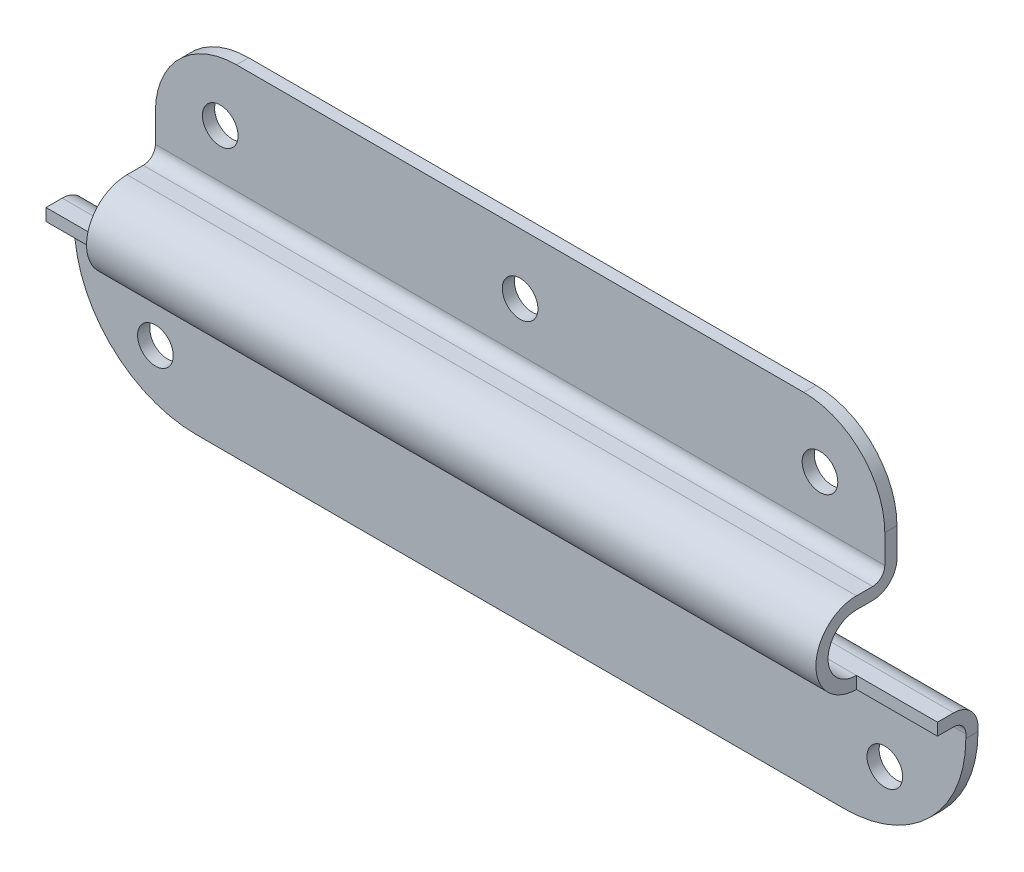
ISO-10303-21;
HEADER;
FILE_DESCRIPTION(('STEP AP214'),'2;1');
FILE_NAME('part.step','',(''),(''),'','','');
FILE_SCHEMA(('AUTOMOTIVE_DESIGN { 1 0 10303 214 1 1 1 1 }'));
ENDSEC;
DATA;
#1=APPLICATION_CONTEXT('core data for automotive mechanical design processes');
#2=APPLICATION_PROTOCOL_DEFINITION('international standard','automotive_design',2000,#1);
#3=PRODUCT_CONTEXT('',#1,'mechanical');
#4=PRODUCT('Part','Part','',(#3));
#5=PRODUCT_RELATED_PRODUCT_CATEGORY('part','',(#4));
#6=PRODUCT_DEFINITION_FORMATION('','',#4);
#7=PRODUCT_DEFINITION_CONTEXT('part definition',#1,'design');
#8=PRODUCT_DEFINITION('design','',#6,#7);
#9=PRODUCT_DEFINITION_SHAPE('','',#8);
#10=(LENGTH_UNIT() NAMED_UNIT(*) SI_UNIT(.MILLI.,.METRE.));
#11=(NAMED_UNIT(*) PLANE_ANGLE_UNIT() SI_UNIT($,.RADIAN.));
#12=(NAMED_UNIT(*) SI_UNIT($,.STERADIAN.) SOLID_ANGLE_UNIT());
#13=UNCERTAINTY_MEASURE_WITH_UNIT(LENGTH_MEASURE(1.E-05),#10,'distance_accuracy_value','');
#14=(GEOMETRIC_REPRESENTATION_CONTEXT(3) GLOBAL_UNCERTAINTY_ASSIGNED_CONTEXT((#13)) GLOBAL_UNIT_ASSIGNED_CONTEXT((#10,
#11,#12)) REPRESENTATION_CONTEXT('',''));
#15=CARTESIAN_POINT('',(0.,0.,0.));
#16=DIRECTION('',(0.,0.,1.));
#17=DIRECTION('',(1.,0.,0.));
#18=AXIS2_PLACEMENT_3D('',#15,#16,#17);
#19=CARTESIAN_POINT('',(55.,6.5,-2.));
#20=DIRECTION('',(-1.,0.,0.));
#21=DIRECTION('',(0.,0.,1.));
#22=AXIS2_PLACEMENT_3D('',#19,#20,#21);
#23=PLANE('',#22);
#24=DIRECTION('',(0.,-1.,0.));
#25=VECTOR('',#24,1.);
#26=CARTESIAN_POINT('',(55.,5.,0.));
#27=LINE('',#26,#25);
#28=CARTESIAN_POINT('',(55.,-3.5,0.));
#29=VERTEX_POINT('',#28);
#30=CARTESIAN_POINT('',(55.,-5.,0.));
#31=VERTEX_POINT('',#30);
#32=EDGE_CURVE('E540',#29,#31,#27,.T.);
#33=ORIENTED_EDGE('',*,*,#32,.T.);
#34=DIRECTION('',(0.,0.,-1.));
#35=VECTOR('',#34,1.);
#36=CARTESIAN_POINT('',(55.,-5.,0.));
#37=LINE('',#36,#35);
#38=CARTESIAN_POINT('',(55.,-5.,-2.));
#39=VERTEX_POINT('',#38);
#40=EDGE_CURVE('E268',#31,#39,#37,.T.);
#41=ORIENTED_EDGE('',*,*,#40,.T.);
#42=CARTESIAN_POINT('',(55.,-6.5,-2.));
#43=DIRECTION('',(-1.,0.,0.));
#44=DIRECTION('',(0.,0.,1.));
#45=AXIS2_PLACEMENT_3D('',#42,#43,#44);
#46=CIRCLE('',#45,1.5);
#47=CARTESIAN_POINT('',(55.,-6.5,-3.5));
#48=VERTEX_POINT('',#47);
#49=EDGE_CURVE('E270',#39,#48,#46,.T.);
#50=ORIENTED_EDGE('',*,*,#49,.T.);
#51=DIRECTION('',(0.,-1.,0.));
#52=VECTOR('',#51,1.);
#53=CARTESIAN_POINT('',(55.,-6.5,-3.5));
#54=LINE('',#53,#52);
#55=CARTESIAN_POINT('',(55.,-7.,-3.5));
#56=VERTEX_POINT('',#55);
#57=EDGE_CURVE('E273',#48,#56,#54,.T.);
#58=ORIENTED_EDGE('',*,*,#57,.T.);
#59=DIRECTION('',(0.,0.,1.));
#60=VECTOR('',#59,1.);
#61=CARTESIAN_POINT('',(55.,-7.,-5.));
#62=LINE('',#61,#60);
#63=CARTESIAN_POINT('',(55.,-7.,-5.));
#64=VERTEX_POINT('',#63);
#65=EDGE_CURVE('E241',#64,#56,#62,.T.);
#66=ORIENTED_EDGE('',*,*,#65,.F.);
#67=DIRECTION('',(0.,1.,0.));
#68=VECTOR('',#67,1.);
#69=CARTESIAN_POINT('',(55.,-22.,-5.));
#70=LINE('',#69,#68);
#71=CARTESIAN_POINT('',(55.,-6.5,-5.));
#72=VERTEX_POINT('',#71);
#73=EDGE_CURVE('E276',#64,#72,#70,.T.);
#74=ORIENTED_EDGE('',*,*,#73,.T.);
#75=CARTESIAN_POINT('',(55.,-6.5,-2.));
#76=DIRECTION('',(1.,0.,0.));
#77=DIRECTION('',(0.,0.,-1.));
#78=AXIS2_PLACEMENT_3D('',#75,#76,#77);
#79=CIRCLE('',#78,3.);
#80=CARTESIAN_POINT('',(55.,-3.5,-2.));
#81=VERTEX_POINT('',#80);
#82=EDGE_CURVE('E278',#72,#81,#79,.T.);
#83=ORIENTED_EDGE('',*,*,#82,.T.);
#84=DIRECTION('',(0.,0.,1.));
#85=VECTOR('',#84,1.);
#86=CARTESIAN_POINT('',(55.,-3.5,-2.));
#87=LINE('',#86,#85);
#88=EDGE_CURVE('E280',#81,#29,#87,.T.);
#89=ORIENTED_EDGE('',*,*,#88,.T.);
#90=EDGE_LOOP('',(#33,#41,#50,#58,#66,#74,#83,#89));
#91=FACE_BOUND('',#90,.T.);
#92=ADVANCED_FACE('F35',(#91),#23,.F.);
#93=CARTESIAN_POINT('',(55.,20.,-5.));
#94=DIRECTION('',(0.,-1.,0.));
#95=DIRECTION('',(0.,0.,-1.));
#96=AXIS2_PLACEMENT_3D('',#93,#94,#95);
#97=PLANE('',#96);
#98=DIRECTION('',(0.,0.,1.));
#99=VECTOR('',#98,1.);
#100=CARTESIAN_POINT('',(-35.,20.,-5.));
#101=LINE('',#100,#99);
#102=CARTESIAN_POINT('',(-35.,20.,-5.));
#103=VERTEX_POINT('',#102);
#104=CARTESIAN_POINT('',(-35.,20.,-3.5));
#105=VERTEX_POINT('',#104);
#106=EDGE_CURVE('E402',#103,#105,#101,.T.);
#107=ORIENTED_EDGE('',*,*,#106,.T.);
#108=DIRECTION('',(-1.,0.,0.));
#109=VECTOR('',#108,1.);
#110=CARTESIAN_POINT('',(55.,20.,-3.5));
#111=LINE('',#110,#109);
#112=CARTESIAN_POINT('',(35.,20.,-3.5));
#113=VERTEX_POINT('',#112);
#114=EDGE_CURVE('E11',#113,#105,#111,.T.);
#115=ORIENTED_EDGE('',*,*,#114,.F.);
#116=DIRECTION('',(0.,0.,1.));
#117=VECTOR('',#116,1.);
#118=CARTESIAN_POINT('',(35.,20.,-5.));
#119=LINE('',#118,#117);
#120=CARTESIAN_POINT('',(35.,20.,-5.));
#121=VERTEX_POINT('',#120);
#122=EDGE_CURVE('E253',#121,#113,#119,.T.);
#123=ORIENTED_EDGE('',*,*,#122,.F.);
#124=DIRECTION('',(-1.,0.,0.));
#125=VECTOR('',#124,1.);
#126=CARTESIAN_POINT('',(55.,20.,-5.));
#127=LINE('',#126,#125);
#128=EDGE_CURVE('E283',#121,#103,#127,.T.);
#129=ORIENTED_EDGE('',*,*,#128,.T.);
#130=EDGE_LOOP('',(#107,#115,#123,#129));
#131=FACE_BOUND('',#130,.T.);
#132=ADVANCED_FACE('F37',(#131),#97,.F.);
#133=CARTESIAN_POINT('',(55.,-22.,-3.5));
#134=DIRECTION('',(0.,1.,0.));
#135=DIRECTION('',(0.,0.,1.));
#136=AXIS2_PLACEMENT_3D('',#133,#134,#135);
#137=PLANE('',#136);
#138=DIRECTION('',(-1.,0.,0.));
#139=VECTOR('',#138,1.);
#140=CARTESIAN_POINT('',(55.,-22.,-3.5));
#141=LINE('',#140,#139);
#142=CARTESIAN_POINT('',(40.,-22.,-3.5));
#143=VERTEX_POINT('',#142);
#144=CARTESIAN_POINT('',(-40.,-22.,-3.5));
#145=VERTEX_POINT('',#144);
#146=EDGE_CURVE('E319',#143,#145,#141,.T.);
#147=ORIENTED_EDGE('',*,*,#146,.T.);
#148=DIRECTION('',(0.,0.,1.));
#149=VECTOR('',#148,1.);
#150=CARTESIAN_POINT('',(-40.,-22.,-5.));
#151=LINE('',#150,#149);
#152=CARTESIAN_POINT('',(-40.,-22.,-5.));
#153=VERTEX_POINT('',#152);
#154=EDGE_CURVE('E391',#153,#145,#151,.T.);
#155=ORIENTED_EDGE('',*,*,#154,.F.);
#156=DIRECTION('',(-1.,0.,0.));
#157=VECTOR('',#156,1.);
#158=CARTESIAN_POINT('',(55.,-22.,-5.));
#159=LINE('',#158,#157);
#160=CARTESIAN_POINT('',(40.,-22.,-5.));
#161=VERTEX_POINT('',#160);
#162=EDGE_CURVE('E316',#161,#153,#159,.T.);
#163=ORIENTED_EDGE('',*,*,#162,.F.);
#164=DIRECTION('',(0.,0.,1.));
#165=VECTOR('',#164,1.);
#166=CARTESIAN_POINT('',(40.,-22.,-5.));
#167=LINE('',#166,#165);
#168=EDGE_CURVE('E58',#161,#143,#167,.T.);
#169=ORIENTED_EDGE('',*,*,#168,.T.);
#170=EDGE_LOOP('',(#147,#155,#163,#169));
#171=FACE_BOUND('',#170,.T.);
#172=ADVANCED_FACE('F447',(#171),#137,.F.);
#173=CARTESIAN_POINT('',(55.,20.,-3.5));
#174=DIRECTION('',(0.,0.,-1.));
#175=DIRECTION('',(0.,1.,0.));
#176=AXIS2_PLACEMENT_3D('',#173,#174,#175);
#177=PLANE('',#176);
#178=CARTESIAN_POINT('',(-37.,12.5,-3.5));
#179=DIRECTION('',(0.,0.,-1.));
#180=DIRECTION('',(0.,1.,0.));
#181=AXIS2_PLACEMENT_3D('',#178,#179,#180);
#182=CIRCLE('',#181,2.2);
#183=CARTESIAN_POINT('',(-37.,14.7,-3.5));
#184=VERTEX_POINT('',#183);
#185=EDGE_CURVE('E372',#184,#184,#182,.T.);
#186=ORIENTED_EDGE('',*,*,#185,.T.);
#187=EDGE_LOOP('',(#186));
#188=FACE_BOUND('',#187,.T.);
#189=CARTESIAN_POINT('',(0.,12.5,-3.5));
#190=DIRECTION('',(0.,0.,-1.));
#191=DIRECTION('',(0.,1.,0.));
#192=AXIS2_PLACEMENT_3D('',#189,#190,#191);
#193=CIRCLE('',#192,2.2);
#194=CARTESIAN_POINT('',(0.,14.7,-3.5));
#195=VERTEX_POINT('',#194);
#196=EDGE_CURVE('E378',#195,#195,#193,.T.);
#197=ORIENTED_EDGE('',*,*,#196,.T.);
#198=EDGE_LOOP('',(#197));
#199=FACE_BOUND('',#198,.T.);
#200=CARTESIAN_POINT('',(37.,12.5,-3.5));
#201=DIRECTION('',(0.,0.,-1.));
#202=DIRECTION('',(0.,1.,0.));
#203=AXIS2_PLACEMENT_3D('',#200,#201,#202);
#204=CIRCLE('',#203,2.2);
#205=CARTESIAN_POINT('',(37.,14.7,-3.5));
#206=VERTEX_POINT('',#205);
#207=EDGE_CURVE('E384',#206,#206,#204,.T.);
#208=ORIENTED_EDGE('',*,*,#207,.T.);
#209=EDGE_LOOP('',(#208));
#210=FACE_BOUND('',#209,.T.);
#211=ORIENTED_EDGE('',*,*,#114,.T.);
#212=CARTESIAN_POINT('',(-35.,10.,-3.5));
#213=DIRECTION('',(0.,0.,-1.));
#214=DIRECTION('',(0.,1.,0.));
#215=AXIS2_PLACEMENT_3D('',#212,#213,#214);
#216=CIRCLE('',#215,10.);
#217=CARTESIAN_POINT('',(-45.,10.,-3.5));
#218=VERTEX_POINT('',#217);
#219=EDGE_CURVE('E231',#105,#218,#216,.F.);
#220=ORIENTED_EDGE('',*,*,#219,.T.);
#221=DIRECTION('',(0.,-1.,0.));
#222=VECTOR('',#221,1.);
#223=CARTESIAN_POINT('',(-45.,19.9999999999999,-3.5));
#224=LINE('',#223,#222);
#225=CARTESIAN_POINT('',(-45.,6.5,-3.5));
#226=VERTEX_POINT('',#225);
#227=EDGE_CURVE('E230',#218,#226,#224,.T.);
#228=ORIENTED_EDGE('',*,*,#227,.T.);
#229=DIRECTION('',(-1.,0.,0.));
#230=VECTOR('',#229,1.);
#231=CARTESIAN_POINT('',(55.,6.5,-3.5));
#232=LINE('',#231,#230);
#233=CARTESIAN_POINT('',(45.,6.5,-3.5));
#234=VERTEX_POINT('',#233);
#235=EDGE_CURVE('E43',#234,#226,#232,.T.);
#236=ORIENTED_EDGE('',*,*,#235,.F.);
#237=DIRECTION('',(0.,1.,0.));
#238=VECTOR('',#237,1.);
#239=CARTESIAN_POINT('',(45.,20.,-3.5));
#240=LINE('',#239,#238);
#241=CARTESIAN_POINT('',(45.,10.,-3.5));
#242=VERTEX_POINT('',#241);
#243=EDGE_CURVE('E228',#234,#242,#240,.T.);
#244=ORIENTED_EDGE('',*,*,#243,.T.);
#245=CARTESIAN_POINT('',(35.,10.,-3.5));
#246=DIRECTION('',(0.,0.,-1.));
#247=DIRECTION('',(0.,1.,0.));
#248=AXIS2_PLACEMENT_3D('',#245,#246,#247);
#249=CIRCLE('',#248,10.);
#250=EDGE_CURVE('E257',#242,#113,#249,.F.);
#251=ORIENTED_EDGE('',*,*,#250,.T.);
#252=EDGE_LOOP('',(#211,#220,#228,#236,#244,#251));
#253=FACE_BOUND('',#252,.T.);
#254=ADVANCED_FACE('F226',(#188,#199,#210,#253),#177,.F.);
#255=CARTESIAN_POINT('',(55.,6.5,-2.));
#256=DIRECTION('',(-1.,0.,0.));
#257=DIRECTION('',(0.,0.,1.));
#258=AXIS2_PLACEMENT_3D('',#255,#256,#257);
#259=CYLINDRICAL_SURFACE('',#258,1.5);
#260=ORIENTED_EDGE('',*,*,#235,.T.);
#261=CARTESIAN_POINT('',(-45.,6.5,-2.));
#262=DIRECTION('',(1.,0.,0.));
#263=DIRECTION('',(0.,1.,0.));
#264=AXIS2_PLACEMENT_3D('',#261,#262,#263);
#265=CIRCLE('',#264,1.5);
#266=CARTESIAN_POINT('',(-45.,5.,-2.));
#267=VERTEX_POINT('',#266);
#268=EDGE_CURVE('E222',#226,#267,#265,.F.);
#269=ORIENTED_EDGE('',*,*,#268,.T.);
#270=DIRECTION('',(-1.,0.,0.));
#271=VECTOR('',#270,1.);
#272=CARTESIAN_POINT('',(55.,5.,-2.));
#273=LINE('',#272,#271);
#274=CARTESIAN_POINT('',(45.,5.,-2.));
#275=VERTEX_POINT('',#274);
#276=EDGE_CURVE('E211',#275,#267,#273,.T.);
#277=ORIENTED_EDGE('',*,*,#276,.F.);
#278=CARTESIAN_POINT('',(45.,6.5,-2.));
#279=DIRECTION('',(-1.,0.,0.));
#280=DIRECTION('',(0.,-1.,0.));
#281=AXIS2_PLACEMENT_3D('',#278,#279,#280);
#282=CIRCLE('',#281,1.5);
#283=EDGE_CURVE('E202',#275,#234,#282,.F.);
#284=ORIENTED_EDGE('',*,*,#283,.T.);
#285=EDGE_LOOP('',(#260,#269,#277,#284));
#286=FACE_BOUND('',#285,.T.);
#287=ADVANCED_FACE('F221',(#286),#259,.F.);
#288=CARTESIAN_POINT('',(55.,5.,-2.));
#289=DIRECTION('',(0.,-1.,0.));
#290=DIRECTION('',(0.,0.,-1.));
#291=AXIS2_PLACEMENT_3D('',#288,#289,#290);
#292=PLANE('',#291);
#293=ORIENTED_EDGE('',*,*,#276,.T.);
#294=DIRECTION('',(0.,0.,1.));
#295=VECTOR('',#294,1.);
#296=CARTESIAN_POINT('',(-45.,5.,-2.));
#297=LINE('',#296,#295);
#298=CARTESIAN_POINT('',(-45.,5.,0.));
#299=VERTEX_POINT('',#298);
#300=EDGE_CURVE('E210',#267,#299,#297,.T.);
#301=ORIENTED_EDGE('',*,*,#300,.T.);
#302=DIRECTION('',(-1.,0.,0.));
#303=VECTOR('',#302,1.);
#304=CARTESIAN_POINT('',(55.,5.,0.));
#305=LINE('',#304,#303);
#306=CARTESIAN_POINT('',(45.,5.,0.));
#307=VERTEX_POINT('',#306);
#308=EDGE_CURVE('E189',#307,#299,#305,.T.);
#309=ORIENTED_EDGE('',*,*,#308,.F.);
#310=DIRECTION('',(0.,0.,-1.));
#311=VECTOR('',#310,1.);
#312=CARTESIAN_POINT('',(45.,5.,-2.));
#313=LINE('',#312,#311);
#314=EDGE_CURVE('E199',#307,#275,#313,.T.);
#315=ORIENTED_EDGE('',*,*,#314,.T.);
#316=EDGE_LOOP('',(#293,#301,#309,#315));
#317=FACE_BOUND('',#316,.T.);
#318=ADVANCED_FACE('F209',(#317),#292,.F.);
#319=CARTESIAN_POINT('',(55.,0.,0.));
#320=DIRECTION('',(-1.,0.,0.));
#321=DIRECTION('',(0.,0.,1.));
#322=AXIS2_PLACEMENT_3D('',#319,#320,#321);
#323=CYLINDRICAL_SURFACE('',#322,5.);
#324=CARTESIAN_POINT('',(45.,0.,0.));
#325=DIRECTION('',(-1.,0.,0.));
#326=DIRECTION('',(0.,0.,1.));
#327=AXIS2_PLACEMENT_3D('',#324,#325,#326);
#328=CIRCLE('',#327,5.);
#329=CARTESIAN_POINT('',(45.,-5.,0.));
#330=VERTEX_POINT('',#329);
#331=EDGE_CURVE('E184',#330,#307,#328,.T.);
#332=ORIENTED_EDGE('',*,*,#331,.T.);
#333=ORIENTED_EDGE('',*,*,#308,.T.);
#334=CARTESIAN_POINT('',(-45.,0.,0.));
#335=DIRECTION('',(1.,0.,0.));
#336=DIRECTION('',(0.,0.,-1.));
#337=AXIS2_PLACEMENT_3D('',#334,#335,#336);
#338=CIRCLE('',#337,5.);
#339=CARTESIAN_POINT('',(-45.,-5.,0.));
#340=VERTEX_POINT('',#339);
#341=EDGE_CURVE('E337',#299,#340,#338,.T.);
#342=ORIENTED_EDGE('',*,*,#341,.T.);
#343=DIRECTION('',(-1.,0.,0.));
#344=VECTOR('',#343,1.);
#345=CARTESIAN_POINT('',(55.,-5.,0.));
#346=LINE('',#345,#344);
#347=EDGE_CURVE('E190',#330,#340,#346,.T.);
#348=ORIENTED_EDGE('',*,*,#347,.F.);
#349=EDGE_LOOP('',(#332,#333,#342,#348));
#350=FACE_BOUND('',#349,.T.);
#351=ADVANCED_FACE('F186',(#350),#323,.T.);
#352=CARTESIAN_POINT('',(55.,-5.,0.));
#353=DIRECTION('',(0.,1.,0.));
#354=DIRECTION('',(0.,0.,1.));
#355=AXIS2_PLACEMENT_3D('',#352,#353,#354);
#356=PLANE('',#355);
#357=DIRECTION('',(0.,0.,-1.));
#358=VECTOR('',#357,1.);
#359=CARTESIAN_POINT('',(-55.,-5.,0.));
#360=LINE('',#359,#358);
#361=CARTESIAN_POINT('',(-55.,-5.,0.));
#362=VERTEX_POINT('',#361);
#363=CARTESIAN_POINT('',(-55.,-5.,-2.));
#364=VERTEX_POINT('',#363);
#365=EDGE_CURVE('E267',#362,#364,#360,.T.);
#366=ORIENTED_EDGE('',*,*,#365,.T.);
#367=DIRECTION('',(-1.,0.,0.));
#368=VECTOR('',#367,1.);
#369=CARTESIAN_POINT('',(55.,-5.,-2.));
#370=LINE('',#369,#368);
#371=EDGE_CURVE('E324',#39,#364,#370,.T.);
#372=ORIENTED_EDGE('',*,*,#371,.F.);
#373=ORIENTED_EDGE('',*,*,#40,.F.);
#374=EDGE_CURVE('E212',#31,#330,#346,.T.);
#375=ORIENTED_EDGE('',*,*,#374,.T.);
#376=ORIENTED_EDGE('',*,*,#347,.T.);
#377=DIRECTION('',(-1.,0.,0.));
#378=VECTOR('',#377,1.);
#379=CARTESIAN_POINT('',(-45.,-5.,0.));
#380=LINE('',#379,#378);
#381=EDGE_CURVE('E334',#340,#362,#380,.T.);
#382=ORIENTED_EDGE('',*,*,#381,.T.);
#383=EDGE_LOOP('',(#366,#372,#373,#375,#376,#382));
#384=FACE_BOUND('',#383,.T.);
#385=ADVANCED_FACE('F332',(#384),#356,.F.);
#386=CARTESIAN_POINT('',(55.,-6.5,-2.));
#387=DIRECTION('',(-1.,0.,0.));
#388=DIRECTION('',(0.,0.,1.));
#389=AXIS2_PLACEMENT_3D('',#386,#387,#388);
#390=CYLINDRICAL_SURFACE('',#389,1.5);
#391=CARTESIAN_POINT('',(-55.,-6.5,-2.));
#392=DIRECTION('',(-1.,0.,0.));
#393=DIRECTION('',(0.,0.,1.));
#394=AXIS2_PLACEMENT_3D('',#391,#392,#393);
#395=CIRCLE('',#394,1.5);
#396=CARTESIAN_POINT('',(-55.,-6.5,-3.5));
#397=VERTEX_POINT('',#396);
#398=EDGE_CURVE('E285',#364,#397,#395,.T.);
#399=ORIENTED_EDGE('',*,*,#398,.T.);
#400=DIRECTION('',(-1.,0.,0.));
#401=VECTOR('',#400,1.);
#402=CARTESIAN_POINT('',(55.,-6.5,-3.5));
#403=LINE('',#402,#401);
#404=EDGE_CURVE('E322',#48,#397,#403,.T.);
#405=ORIENTED_EDGE('',*,*,#404,.F.);
#406=ORIENTED_EDGE('',*,*,#49,.F.);
#407=ORIENTED_EDGE('',*,*,#371,.T.);
#408=EDGE_LOOP('',(#399,#405,#406,#407));
#409=FACE_BOUND('',#408,.T.);
#410=ADVANCED_FACE('F485',(#409),#390,.F.);
#411=CARTESIAN_POINT('',(55.,-6.5,-3.5));
#412=DIRECTION('',(0.,0.,-1.));
#413=DIRECTION('',(0.,1.,0.));
#414=AXIS2_PLACEMENT_3D('',#411,#412,#413);
#415=PLANE('',#414);
#416=CARTESIAN_POINT('',(45.,-15.,-3.5));
#417=DIRECTION('',(0.,0.,-1.));
#418=DIRECTION('',(0.,1.,0.));
#419=AXIS2_PLACEMENT_3D('',#416,#417,#418);
#420=CIRCLE('',#419,2.2);
#421=CARTESIAN_POINT('',(45.,-12.8,-3.5));
#422=VERTEX_POINT('',#421);
#423=EDGE_CURVE('E360',#422,#422,#420,.T.);
#424=ORIENTED_EDGE('',*,*,#423,.T.);
#425=EDGE_LOOP('',(#424));
#426=FACE_BOUND('',#425,.T.);
#427=CARTESIAN_POINT('',(-45.,-15.,-3.5));
#428=DIRECTION('',(0.,0.,-1.));
#429=DIRECTION('',(0.,1.,0.));
#430=AXIS2_PLACEMENT_3D('',#427,#428,#429);
#431=CIRCLE('',#430,2.2);
#432=CARTESIAN_POINT('',(-45.,-12.8,-3.5));
#433=VERTEX_POINT('',#432);
#434=EDGE_CURVE('E366',#433,#433,#431,.T.);
#435=ORIENTED_EDGE('',*,*,#434,.T.);
#436=EDGE_LOOP('',(#435));
#437=FACE_BOUND('',#436,.T.);
#438=DIRECTION('',(0.,-1.,0.));
#439=VECTOR('',#438,1.);
#440=CARTESIAN_POINT('',(-55.,-6.5,-3.5));
#441=LINE('',#440,#439);
#442=CARTESIAN_POINT('',(-55.,-7.,-3.5));
#443=VERTEX_POINT('',#442);
#444=EDGE_CURVE('E287',#397,#443,#441,.T.);
#445=ORIENTED_EDGE('',*,*,#444,.T.);
#446=CARTESIAN_POINT('',(-40.,-7.,-3.5));
#447=DIRECTION('',(0.,0.,-1.));
#448=DIRECTION('',(0.,1.,0.));
#449=AXIS2_PLACEMENT_3D('',#446,#447,#448);
#450=CIRCLE('',#449,15.);
#451=EDGE_CURVE('E50',#443,#145,#450,.F.);
#452=ORIENTED_EDGE('',*,*,#451,.T.);
#453=ORIENTED_EDGE('',*,*,#146,.F.);
#454=CARTESIAN_POINT('',(40.,-7.,-3.5));
#455=DIRECTION('',(0.,0.,-1.));
#456=DIRECTION('',(0.,1.,0.));
#457=AXIS2_PLACEMENT_3D('',#454,#455,#456);
#458=CIRCLE('',#457,15.);
#459=EDGE_CURVE('E243',#143,#56,#458,.F.);
#460=ORIENTED_EDGE('',*,*,#459,.T.);
#461=ORIENTED_EDGE('',*,*,#57,.F.);
#462=ORIENTED_EDGE('',*,*,#404,.T.);
#463=EDGE_LOOP('',(#445,#452,#453,#460,#461,#462));
#464=FACE_BOUND('',#463,.T.);
#465=ADVANCED_FACE('F478',(#426,#437,#464),#415,.F.);
#466=CARTESIAN_POINT('',(55.,-22.,-5.));
#467=DIRECTION('',(0.,0.,1.));
#468=DIRECTION('',(0.,-1.,0.));
#469=AXIS2_PLACEMENT_3D('',#466,#467,#468);
#470=PLANE('',#469);
#471=CARTESIAN_POINT('',(45.,-15.,-5.));
#472=DIRECTION('',(0.,0.,1.));
#473=DIRECTION('',(1.,0.,0.));
#474=AXIS2_PLACEMENT_3D('',#471,#472,#473);
#475=CIRCLE('',#474,2.2);
#476=CARTESIAN_POINT('',(47.2,-15.,-5.));
#477=VERTEX_POINT('',#476);
#478=EDGE_CURVE('E357',#477,#477,#475,.T.);
#479=ORIENTED_EDGE('',*,*,#478,.T.);
#480=EDGE_LOOP('',(#479));
#481=FACE_BOUND('',#480,.T.);
#482=CARTESIAN_POINT('',(-45.,-15.,-5.));
#483=DIRECTION('',(0.,0.,1.));
#484=DIRECTION('',(1.,0.,0.));
#485=AXIS2_PLACEMENT_3D('',#482,#483,#484);
#486=CIRCLE('',#485,2.2);
#487=CARTESIAN_POINT('',(-42.8,-15.,-5.));
#488=VERTEX_POINT('',#487);
#489=EDGE_CURVE('E363',#488,#488,#486,.T.);
#490=ORIENTED_EDGE('',*,*,#489,.T.);
#491=EDGE_LOOP('',(#490));
#492=FACE_BOUND('',#491,.T.);
#493=ORIENTED_EDGE('',*,*,#162,.T.);
#494=CARTESIAN_POINT('',(-40.,-7.,-5.));
#495=DIRECTION('',(0.,0.,-1.));
#496=DIRECTION('',(-1.,0.,0.));
#497=AXIS2_PLACEMENT_3D('',#494,#495,#496);
#498=CIRCLE('',#497,15.);
#499=CARTESIAN_POINT('',(-55.,-7.,-5.));
#500=VERTEX_POINT('',#499);
#501=EDGE_CURVE('E387',#153,#500,#498,.T.);
#502=ORIENTED_EDGE('',*,*,#501,.T.);
#503=DIRECTION('',(0.,1.,0.));
#504=VECTOR('',#503,1.);
#505=CARTESIAN_POINT('',(-55.,-22.,-5.));
#506=LINE('',#505,#504);
#507=CARTESIAN_POINT('',(-55.,-6.5,-5.));
#508=VERTEX_POINT('',#507);
#509=EDGE_CURVE('E290',#500,#508,#506,.T.);
#510=ORIENTED_EDGE('',*,*,#509,.T.);
#511=DIRECTION('',(-1.,0.,0.));
#512=VECTOR('',#511,1.);
#513=CARTESIAN_POINT('',(55.,-6.5,-5.));
#514=LINE('',#513,#512);
#515=EDGE_CURVE('E313',#72,#508,#514,.T.);
#516=ORIENTED_EDGE('',*,*,#515,.F.);
#517=ORIENTED_EDGE('',*,*,#73,.F.);
#518=CARTESIAN_POINT('',(40.,-7.,-5.));
#519=DIRECTION('',(0.,0.,-1.));
#520=DIRECTION('',(-1.,0.,0.));
#521=AXIS2_PLACEMENT_3D('',#518,#519,#520);
#522=CIRCLE('',#521,15.);
#523=EDGE_CURVE('E235',#64,#161,#522,.T.);
#524=ORIENTED_EDGE('',*,*,#523,.T.);
#525=EDGE_LOOP('',(#493,#502,#510,#516,#517,#524));
#526=FACE_BOUND('',#525,.T.);
#527=ADVANCED_FACE('F474',(#481,#492,#526),#470,.F.);
#528=CARTESIAN_POINT('',(55.,-6.5,-2.));
#529=DIRECTION('',(-1.,0.,0.));
#530=DIRECTION('',(0.,0.,1.));
#531=AXIS2_PLACEMENT_3D('',#528,#529,#530);
#532=CYLINDRICAL_SURFACE('',#531,3.);
#533=CARTESIAN_POINT('',(-55.,-6.5,-2.));
#534=DIRECTION('',(1.,0.,0.));
#535=DIRECTION('',(0.,0.,-1.));
#536=AXIS2_PLACEMENT_3D('',#533,#534,#535);
#537=CIRCLE('',#536,3.);
#538=CARTESIAN_POINT('',(-55.,-3.5,-2.));
#539=VERTEX_POINT('',#538);
#540=EDGE_CURVE('E292',#508,#539,#537,.T.);
#541=ORIENTED_EDGE('',*,*,#540,.T.);
#542=DIRECTION('',(-1.,0.,0.));
#543=VECTOR('',#542,1.);
#544=CARTESIAN_POINT('',(55.,-3.5,-2.));
#545=LINE('',#544,#543);
#546=EDGE_CURVE('E310',#81,#539,#545,.T.);
#547=ORIENTED_EDGE('',*,*,#546,.F.);
#548=ORIENTED_EDGE('',*,*,#82,.F.);
#549=ORIENTED_EDGE('',*,*,#515,.T.);
#550=EDGE_LOOP('',(#541,#547,#548,#549));
#551=FACE_BOUND('',#550,.T.);
#552=ADVANCED_FACE('F470',(#551),#532,.T.);
#553=CARTESIAN_POINT('',(55.,-3.5,-2.));
#554=DIRECTION('',(0.,-1.,0.));
#555=DIRECTION('',(0.,0.,-1.));
#556=AXIS2_PLACEMENT_3D('',#553,#554,#555);
#557=PLANE('',#556);
#558=DIRECTION('',(0.,0.,1.));
#559=VECTOR('',#558,1.);
#560=CARTESIAN_POINT('',(-55.,-3.5,-2.));
#561=LINE('',#560,#559);
#562=CARTESIAN_POINT('',(-55.,-3.5,0.));
#563=VERTEX_POINT('',#562);
#564=EDGE_CURVE('E271',#539,#563,#561,.T.);
#565=ORIENTED_EDGE('',*,*,#564,.T.);
#566=DIRECTION('',(-1.,0.,0.));
#567=VECTOR('',#566,1.);
#568=CARTESIAN_POINT('',(55.,-3.5,0.));
#569=LINE('',#568,#567);
#570=CARTESIAN_POINT('',(-45.,-3.5,0.));
#571=VERTEX_POINT('',#570);
#572=EDGE_CURVE('E339',#563,#571,#569,.F.);
#573=ORIENTED_EDGE('',*,*,#572,.T.);
#574=DIRECTION('',(-1.,0.,0.));
#575=VECTOR('',#574,1.);
#576=CARTESIAN_POINT('',(55.,-3.5,0.));
#577=LINE('',#576,#575);
#578=CARTESIAN_POINT('',(45.,-3.5,0.));
#579=VERTEX_POINT('',#578);
#580=EDGE_CURVE('E307',#579,#571,#577,.T.);
#581=ORIENTED_EDGE('',*,*,#580,.F.);
#582=EDGE_CURVE('E308',#29,#579,#577,.T.);
#583=ORIENTED_EDGE('',*,*,#582,.F.);
#584=ORIENTED_EDGE('',*,*,#88,.F.);
#585=ORIENTED_EDGE('',*,*,#546,.T.);
#586=EDGE_LOOP('',(#565,#573,#581,#583,#584,#585));
#587=FACE_BOUND('',#586,.T.);
#588=ADVANCED_FACE('F466',(#587),#557,.F.);
#589=CARTESIAN_POINT('',(55.,0.,0.));
#590=DIRECTION('',(-1.,0.,0.));
#591=DIRECTION('',(0.,0.,1.));
#592=AXIS2_PLACEMENT_3D('',#589,#590,#591);
#593=CYLINDRICAL_SURFACE('',#592,3.5);
#594=DIRECTION('',(-1.,0.,0.));
#595=VECTOR('',#594,1.);
#596=CARTESIAN_POINT('',(55.,3.5,0.));
#597=LINE('',#596,#595);
#598=CARTESIAN_POINT('',(45.,3.5,0.));
#599=VERTEX_POINT('',#598);
#600=CARTESIAN_POINT('',(-45.,3.5,0.));
#601=VERTEX_POINT('',#600);
#602=EDGE_CURVE('E304',#599,#601,#597,.T.);
#603=ORIENTED_EDGE('',*,*,#602,.F.);
#604=CARTESIAN_POINT('',(45.,0.,0.));
#605=DIRECTION('',(-1.,0.,0.));
#606=DIRECTION('',(0.,0.,1.));
#607=AXIS2_PLACEMENT_3D('',#604,#605,#606);
#608=CIRCLE('',#607,3.5);
#609=EDGE_CURVE('E196',#599,#579,#608,.F.);
#610=ORIENTED_EDGE('',*,*,#609,.T.);
#611=ORIENTED_EDGE('',*,*,#580,.T.);
#612=CARTESIAN_POINT('',(-45.,0.,0.));
#613=DIRECTION('',(1.,0.,0.));
#614=DIRECTION('',(0.,0.,-1.));
#615=AXIS2_PLACEMENT_3D('',#612,#613,#614);
#616=CIRCLE('',#615,3.5);
#617=EDGE_CURVE('E340',#571,#601,#616,.F.);
#618=ORIENTED_EDGE('',*,*,#617,.T.);
#619=EDGE_LOOP('',(#603,#610,#611,#618));
#620=FACE_BOUND('',#619,.T.);
#621=ADVANCED_FACE('F463',(#620),#593,.F.);
#622=CARTESIAN_POINT('',(55.,3.5,0.));
#623=DIRECTION('',(0.,1.,0.));
#624=DIRECTION('',(0.,0.,1.));
#625=AXIS2_PLACEMENT_3D('',#622,#623,#624);
#626=PLANE('',#625);
#627=ORIENTED_EDGE('',*,*,#602,.T.);
#628=DIRECTION('',(0.,0.,-1.));
#629=VECTOR('',#628,1.);
#630=CARTESIAN_POINT('',(-45.,3.5,0.));
#631=LINE('',#630,#629);
#632=CARTESIAN_POINT('',(-45.,3.5,-2.));
#633=VERTEX_POINT('',#632);
#634=EDGE_CURVE('E409',#601,#633,#631,.T.);
#635=ORIENTED_EDGE('',*,*,#634,.T.);
#636=DIRECTION('',(-1.,0.,0.));
#637=VECTOR('',#636,1.);
#638=CARTESIAN_POINT('',(55.,3.5,-2.));
#639=LINE('',#638,#637);
#640=CARTESIAN_POINT('',(45.,3.5,-2.));
#641=VERTEX_POINT('',#640);
#642=EDGE_CURVE('E301',#641,#633,#639,.T.);
#643=ORIENTED_EDGE('',*,*,#642,.F.);
#644=DIRECTION('',(0.,0.,1.));
#645=VECTOR('',#644,1.);
#646=CARTESIAN_POINT('',(45.,3.5,0.));
#647=LINE('',#646,#645);
#648=EDGE_CURVE('E206',#641,#599,#647,.T.);
#649=ORIENTED_EDGE('',*,*,#648,.T.);
#650=EDGE_LOOP('',(#627,#635,#643,#649));
#651=FACE_BOUND('',#650,.T.);
#652=ADVANCED_FACE('F413',(#651),#626,.F.);
#653=CARTESIAN_POINT('',(55.,6.5,-2.));
#654=DIRECTION('',(-1.,0.,0.));
#655=DIRECTION('',(0.,0.,1.));
#656=AXIS2_PLACEMENT_3D('',#653,#654,#655);
#657=CYLINDRICAL_SURFACE('',#656,3.);
#658=ORIENTED_EDGE('',*,*,#642,.T.);
#659=CARTESIAN_POINT('',(-45.,6.5,-2.));
#660=DIRECTION('',(1.,0.,0.));
#661=DIRECTION('',(0.,1.,0.));
#662=AXIS2_PLACEMENT_3D('',#659,#660,#661);
#663=CIRCLE('',#662,3.);
#664=CARTESIAN_POINT('',(-45.,6.5,-5.));
#665=VERTEX_POINT('',#664);
#666=EDGE_CURVE('E405',#633,#665,#663,.T.);
#667=ORIENTED_EDGE('',*,*,#666,.T.);
#668=DIRECTION('',(-1.,0.,0.));
#669=VECTOR('',#668,1.);
#670=CARTESIAN_POINT('',(55.,6.5,-5.));
#671=LINE('',#670,#669);
#672=CARTESIAN_POINT('',(45.,6.5,-5.));
#673=VERTEX_POINT('',#672);
#674=EDGE_CURVE('E298',#673,#665,#671,.T.);
#675=ORIENTED_EDGE('',*,*,#674,.F.);
#676=CARTESIAN_POINT('',(45.,6.5,-2.));
#677=DIRECTION('',(-1.,0.,0.));
#678=DIRECTION('',(0.,-1.,0.));
#679=AXIS2_PLACEMENT_3D('',#676,#677,#678);
#680=CIRCLE('',#679,3.);
#681=EDGE_CURVE('E260',#673,#641,#680,.T.);
#682=ORIENTED_EDGE('',*,*,#681,.T.);
#683=EDGE_LOOP('',(#658,#667,#675,#682));
#684=FACE_BOUND('',#683,.T.);
#685=ADVANCED_FACE('F416',(#684),#657,.T.);
#686=CARTESIAN_POINT('',(55.,6.5,-5.));
#687=DIRECTION('',(0.,0.,1.));
#688=DIRECTION('',(1.,0.,0.));
#689=AXIS2_PLACEMENT_3D('',#686,#687,#688);
#690=PLANE('',#689);
#691=CARTESIAN_POINT('',(-37.,12.5,-5.));
#692=DIRECTION('',(0.,0.,1.));
#693=DIRECTION('',(1.,0.,0.));
#694=AXIS2_PLACEMENT_3D('',#691,#692,#693);
#695=CIRCLE('',#694,2.2);
#696=CARTESIAN_POINT('',(-34.8,12.5,-5.));
#697=VERTEX_POINT('',#696);
#698=EDGE_CURVE('E369',#697,#697,#695,.T.);
#699=ORIENTED_EDGE('',*,*,#698,.T.);
#700=EDGE_LOOP('',(#699));
#701=FACE_BOUND('',#700,.T.);
#702=CARTESIAN_POINT('',(0.,12.5,-5.));
#703=DIRECTION('',(0.,0.,1.));
#704=DIRECTION('',(1.,0.,0.));
#705=AXIS2_PLACEMENT_3D('',#702,#703,#704);
#706=CIRCLE('',#705,2.2);
#707=CARTESIAN_POINT('',(2.2,12.5,-5.));
#708=VERTEX_POINT('',#707);
#709=EDGE_CURVE('E375',#708,#708,#706,.T.);
#710=ORIENTED_EDGE('',*,*,#709,.T.);
#711=EDGE_LOOP('',(#710));
#712=FACE_BOUND('',#711,.T.);
#713=CARTESIAN_POINT('',(37.,12.5,-5.));
#714=DIRECTION('',(0.,0.,1.));
#715=DIRECTION('',(1.,0.,0.));
#716=AXIS2_PLACEMENT_3D('',#713,#714,#715);
#717=CIRCLE('',#716,2.2);
#718=CARTESIAN_POINT('',(39.2,12.5,-5.));
#719=VERTEX_POINT('',#718);
#720=EDGE_CURVE('E381',#719,#719,#717,.T.);
#721=ORIENTED_EDGE('',*,*,#720,.T.);
#722=EDGE_LOOP('',(#721));
#723=FACE_BOUND('',#722,.T.);
#724=DIRECTION('',(0.,1.,0.));
#725=VECTOR('',#724,1.);
#726=CARTESIAN_POINT('',(-45.,10.,-5.));
#727=LINE('',#726,#725);
#728=CARTESIAN_POINT('',(-45.,10.,-5.));
#729=VERTEX_POINT('',#728);
#730=EDGE_CURVE('E395',#665,#729,#727,.T.);
#731=ORIENTED_EDGE('',*,*,#730,.T.);
#732=CARTESIAN_POINT('',(-35.,10.,-5.));
#733=DIRECTION('',(0.,0.,-1.));
#734=DIRECTION('',(1.,0.,0.));
#735=AXIS2_PLACEMENT_3D('',#732,#733,#734);
#736=CIRCLE('',#735,10.);
#737=EDGE_CURVE('E398',#729,#103,#736,.T.);
#738=ORIENTED_EDGE('',*,*,#737,.T.);
#739=ORIENTED_EDGE('',*,*,#128,.F.);
#740=CARTESIAN_POINT('',(35.,10.,-5.));
#741=DIRECTION('',(0.,0.,-1.));
#742=DIRECTION('',(-1.,0.,0.));
#743=AXIS2_PLACEMENT_3D('',#740,#741,#742);
#744=CIRCLE('',#743,10.);
#745=CARTESIAN_POINT('',(45.,10.,-5.));
#746=VERTEX_POINT('',#745);
#747=EDGE_CURVE('E247',#121,#746,#744,.T.);
#748=ORIENTED_EDGE('',*,*,#747,.T.);
#749=DIRECTION('',(0.,-1.,0.));
#750=VECTOR('',#749,1.);
#751=CARTESIAN_POINT('',(45.,10.,-5.));
#752=LINE('',#751,#750);
#753=EDGE_CURVE('E250',#746,#673,#752,.T.);
#754=ORIENTED_EDGE('',*,*,#753,.T.);
#755=ORIENTED_EDGE('',*,*,#674,.T.);
#756=EDGE_LOOP('',(#731,#738,#739,#748,#754,#755));
#757=FACE_BOUND('',#756,.T.);
#758=ADVANCED_FACE('F420',(#701,#712,#723,#757),#690,.F.);
#759=CARTESIAN_POINT('',(-55.,6.5,-2.));
#760=DIRECTION('',(-1.,0.,0.));
#761=DIRECTION('',(0.,0.,1.));
#762=AXIS2_PLACEMENT_3D('',#759,#760,#761);
#763=PLANE('',#762);
#764=DIRECTION('',(0.,1.,0.));
#765=VECTOR('',#764,1.);
#766=CARTESIAN_POINT('',(-55.,5.,0.));
#767=LINE('',#766,#765);
#768=EDGE_CURVE('E351',#362,#563,#767,.T.);
#769=ORIENTED_EDGE('',*,*,#768,.T.);
#770=ORIENTED_EDGE('',*,*,#564,.F.);
#771=ORIENTED_EDGE('',*,*,#540,.F.);
#772=ORIENTED_EDGE('',*,*,#509,.F.);
#773=DIRECTION('',(0.,0.,1.));
#774=VECTOR('',#773,1.);
#775=CARTESIAN_POINT('',(-55.,-7.,-5.));
#776=LINE('',#775,#774);
#777=EDGE_CURVE('E390',#500,#443,#776,.T.);
#778=ORIENTED_EDGE('',*,*,#777,.T.);
#779=ORIENTED_EDGE('',*,*,#444,.F.);
#780=ORIENTED_EDGE('',*,*,#398,.F.);
#781=ORIENTED_EDGE('',*,*,#365,.F.);
#782=EDGE_LOOP('',(#769,#770,#771,#772,#778,#779,#780,#781));
#783=FACE_BOUND('',#782,.T.);
#784=ADVANCED_FACE('F452',(#783),#763,.T.);
#785=CARTESIAN_POINT('',(45.,10.,-5.));
#786=DIRECTION('',(-1.,0.,0.));
#787=DIRECTION('',(0.,-1.,0.));
#788=AXIS2_PLACEMENT_3D('',#785,#786,#787);
#789=PLANE('',#788);
#790=ORIENTED_EDGE('',*,*,#283,.F.);
#791=ORIENTED_EDGE('',*,*,#314,.F.);
#792=ORIENTED_EDGE('',*,*,#331,.F.);
#793=DIRECTION('',(0.,1.,0.));
#794=VECTOR('',#793,1.);
#795=CARTESIAN_POINT('',(45.,5.,0.));
#796=LINE('',#795,#794);
#797=EDGE_CURVE('E539',#330,#579,#796,.T.);
#798=ORIENTED_EDGE('',*,*,#797,.T.);
#799=ORIENTED_EDGE('',*,*,#609,.F.);
#800=ORIENTED_EDGE('',*,*,#648,.F.);
#801=ORIENTED_EDGE('',*,*,#681,.F.);
#802=ORIENTED_EDGE('',*,*,#753,.F.);
#803=DIRECTION('',(0.,0.,1.));
#804=VECTOR('',#803,1.);
#805=CARTESIAN_POINT('',(45.,10.,-5.));
#806=LINE('',#805,#804);
#807=EDGE_CURVE('E254',#746,#242,#806,.T.);
#808=ORIENTED_EDGE('',*,*,#807,.T.);
#809=ORIENTED_EDGE('',*,*,#243,.F.);
#810=EDGE_LOOP('',(#790,#791,#792,#798,#799,#800,#801,#802,#808,#809));
#811=FACE_BOUND('',#810,.T.);
#812=ADVANCED_FACE('F200',(#811),#789,.F.);
#813=CARTESIAN_POINT('',(35.,10.,-5.));
#814=DIRECTION('',(0.,0.,1.));
#815=DIRECTION('',(1.,0.,0.));
#816=AXIS2_PLACEMENT_3D('',#813,#814,#815);
#817=CYLINDRICAL_SURFACE('',#816,10.);
#818=ORIENTED_EDGE('',*,*,#807,.F.);
#819=ORIENTED_EDGE('',*,*,#747,.F.);
#820=ORIENTED_EDGE('',*,*,#122,.T.);
#821=ORIENTED_EDGE('',*,*,#250,.F.);
#822=EDGE_LOOP('',(#818,#819,#820,#821));
#823=FACE_BOUND('',#822,.T.);
#824=ADVANCED_FACE('F424',(#823),#817,.T.);
#825=CARTESIAN_POINT('',(40.,-7.,-5.));
#826=DIRECTION('',(0.,0.,1.));
#827=DIRECTION('',(1.,0.,0.));
#828=AXIS2_PLACEMENT_3D('',#825,#826,#827);
#829=CYLINDRICAL_SURFACE('',#828,15.);
#830=ORIENTED_EDGE('',*,*,#168,.F.);
#831=ORIENTED_EDGE('',*,*,#523,.F.);
#832=ORIENTED_EDGE('',*,*,#65,.T.);
#833=ORIENTED_EDGE('',*,*,#459,.F.);
#834=EDGE_LOOP('',(#830,#831,#832,#833));
#835=FACE_BOUND('',#834,.T.);
#836=ADVANCED_FACE('F431',(#835),#829,.T.);
#837=CARTESIAN_POINT('',(-35.,10.,-5.));
#838=DIRECTION('',(0.,0.,1.));
#839=DIRECTION('',(1.,0.,0.));
#840=AXIS2_PLACEMENT_3D('',#837,#838,#839);
#841=CYLINDRICAL_SURFACE('',#840,10.);
#842=ORIENTED_EDGE('',*,*,#106,.F.);
#843=ORIENTED_EDGE('',*,*,#737,.F.);
#844=DIRECTION('',(0.,0.,1.));
#845=VECTOR('',#844,1.);
#846=CARTESIAN_POINT('',(-45.,10.,-5.));
#847=LINE('',#846,#845);
#848=EDGE_CURVE('E401',#729,#218,#847,.T.);
#849=ORIENTED_EDGE('',*,*,#848,.T.);
#850=ORIENTED_EDGE('',*,*,#219,.F.);
#851=EDGE_LOOP('',(#842,#843,#849,#850));
#852=FACE_BOUND('',#851,.T.);
#853=ADVANCED_FACE('F429',(#852),#841,.T.);
#854=CARTESIAN_POINT('',(-45.,10.,-5.));
#855=DIRECTION('',(1.,0.,0.));
#856=DIRECTION('',(0.,1.,0.));
#857=AXIS2_PLACEMENT_3D('',#854,#855,#856);
#858=PLANE('',#857);
#859=ORIENTED_EDGE('',*,*,#848,.F.);
#860=ORIENTED_EDGE('',*,*,#730,.F.);
#861=ORIENTED_EDGE('',*,*,#666,.F.);
#862=ORIENTED_EDGE('',*,*,#634,.F.);
#863=ORIENTED_EDGE('',*,*,#617,.F.);
#864=DIRECTION('',(0.,-1.,0.));
#865=VECTOR('',#864,1.);
#866=CARTESIAN_POINT('',(-45.,5.,0.));
#867=LINE('',#866,#865);
#868=EDGE_CURVE('E195',#571,#340,#867,.T.);
#869=ORIENTED_EDGE('',*,*,#868,.T.);
#870=ORIENTED_EDGE('',*,*,#341,.F.);
#871=ORIENTED_EDGE('',*,*,#300,.F.);
#872=ORIENTED_EDGE('',*,*,#268,.F.);
#873=ORIENTED_EDGE('',*,*,#227,.F.);
#874=EDGE_LOOP('',(#859,#860,#861,#862,#863,#869,#870,#871,#872,#873));
#875=FACE_BOUND('',#874,.T.);
#876=ADVANCED_FACE('F344',(#875),#858,.F.);
#877=CARTESIAN_POINT('',(-40.,-7.,-5.));
#878=DIRECTION('',(0.,0.,1.));
#879=DIRECTION('',(1.,0.,0.));
#880=AXIS2_PLACEMENT_3D('',#877,#878,#879);
#881=CYLINDRICAL_SURFACE('',#880,15.);
#882=ORIENTED_EDGE('',*,*,#777,.F.);
#883=ORIENTED_EDGE('',*,*,#501,.F.);
#884=ORIENTED_EDGE('',*,*,#154,.T.);
#885=ORIENTED_EDGE('',*,*,#451,.F.);
#886=EDGE_LOOP('',(#882,#883,#884,#885));
#887=FACE_BOUND('',#886,.T.);
#888=ADVANCED_FACE('F437',(#887),#881,.T.);
#889=CARTESIAN_POINT('',(37.,12.5,-5.));
#890=DIRECTION('',(0.,0.,1.));
#891=DIRECTION('',(1.,0.,0.));
#892=AXIS2_PLACEMENT_3D('',#889,#890,#891);
#893=CYLINDRICAL_SURFACE('',#892,2.2);
#894=ORIENTED_EDGE('',*,*,#720,.F.);
#895=EDGE_LOOP('',(#894));
#896=FACE_BOUND('',#895,.T.);
#897=ORIENTED_EDGE('',*,*,#207,.F.);
#898=EDGE_LOOP('',(#897));
#899=FACE_BOUND('',#898,.T.);
#900=ADVANCED_FACE('F506',(#896,#899),#893,.F.);
#901=CARTESIAN_POINT('',(0.,12.5,-5.));
#902=DIRECTION('',(0.,0.,1.));
#903=DIRECTION('',(1.,0.,0.));
#904=AXIS2_PLACEMENT_3D('',#901,#902,#903);
#905=CYLINDRICAL_SURFACE('',#904,2.2);
#906=ORIENTED_EDGE('',*,*,#709,.F.);
#907=EDGE_LOOP('',(#906));
#908=FACE_BOUND('',#907,.T.);
#909=ORIENTED_EDGE('',*,*,#196,.F.);
#910=EDGE_LOOP('',(#909));
#911=FACE_BOUND('',#910,.T.);
#912=ADVANCED_FACE('F508',(#908,#911),#905,.F.);
#913=CARTESIAN_POINT('',(-37.,12.5,-5.));
#914=DIRECTION('',(0.,0.,1.));
#915=DIRECTION('',(1.,0.,0.));
#916=AXIS2_PLACEMENT_3D('',#913,#914,#915);
#917=CYLINDRICAL_SURFACE('',#916,2.2);
#918=ORIENTED_EDGE('',*,*,#698,.F.);
#919=EDGE_LOOP('',(#918));
#920=FACE_BOUND('',#919,.T.);
#921=ORIENTED_EDGE('',*,*,#185,.F.);
#922=EDGE_LOOP('',(#921));
#923=FACE_BOUND('',#922,.T.);
#924=ADVANCED_FACE('F515',(#920,#923),#917,.F.);
#925=CARTESIAN_POINT('',(-45.,-15.,-5.));
#926=DIRECTION('',(0.,0.,1.));
#927=DIRECTION('',(1.,0.,0.));
#928=AXIS2_PLACEMENT_3D('',#925,#926,#927);
#929=CYLINDRICAL_SURFACE('',#928,2.2);
#930=ORIENTED_EDGE('',*,*,#489,.F.);
#931=EDGE_LOOP('',(#930));
#932=FACE_BOUND('',#931,.T.);
#933=ORIENTED_EDGE('',*,*,#434,.F.);
#934=EDGE_LOOP('',(#933));
#935=FACE_BOUND('',#934,.T.);
#936=ADVANCED_FACE('F522',(#932,#935),#929,.F.);
#937=CARTESIAN_POINT('',(45.,-15.,-5.));
#938=DIRECTION('',(0.,0.,1.));
#939=DIRECTION('',(1.,0.,0.));
#940=AXIS2_PLACEMENT_3D('',#937,#938,#939);
#941=CYLINDRICAL_SURFACE('',#940,2.2);
#942=ORIENTED_EDGE('',*,*,#478,.F.);
#943=EDGE_LOOP('',(#942));
#944=FACE_BOUND('',#943,.T.);
#945=ORIENTED_EDGE('',*,*,#423,.F.);
#946=EDGE_LOOP('',(#945));
#947=FACE_BOUND('',#946,.T.);
#948=ADVANCED_FACE('F526',(#944,#947),#941,.F.);
#949=CARTESIAN_POINT('',(0.,0.,0.));
#950=DIRECTION('',(0.,0.,-1.));
#951=DIRECTION('',(-1.,0.,0.));
#952=AXIS2_PLACEMENT_3D('',#949,#950,#951);
#953=PLANE('',#952);
#954=ORIENTED_EDGE('',*,*,#768,.F.);
#955=ORIENTED_EDGE('',*,*,#381,.F.);
#956=ORIENTED_EDGE('',*,*,#868,.F.);
#957=ORIENTED_EDGE('',*,*,#572,.F.);
#958=EDGE_LOOP('',(#954,#955,#956,#957));
#959=FACE_BOUND('',#958,.T.);
#960=ADVANCED_FACE('F349',(#959),#953,.F.);
#961=CARTESIAN_POINT('',(0.,0.,0.));
#962=DIRECTION('',(0.,0.,1.));
#963=DIRECTION('',(1.,0.,0.));
#964=AXIS2_PLACEMENT_3D('',#961,#962,#963);
#965=PLANE('',#964);
#966=ORIENTED_EDGE('',*,*,#582,.T.);
#967=ORIENTED_EDGE('',*,*,#797,.F.);
#968=ORIENTED_EDGE('',*,*,#374,.F.);
#969=ORIENTED_EDGE('',*,*,#32,.F.);
#970=EDGE_LOOP('',(#966,#967,#968,#969));
#971=FACE_BOUND('',#970,.T.);
#972=ADVANCED_FACE('F533',(#971),#965,.T.);
#973=CLOSED_SHELL('',(#92,#132,#172,#254,#287,#318,#351,#385,#410,#465,#527,#552,#588,#621,#652,
#685,#758,#784,#812,#824,#836,#853,#876,#888,#900,#912,#924,#936,#948,#960,#972));
#974=MANIFOLD_SOLID_BREP('B2',#973);
#975=ADVANCED_BREP_SHAPE_REPRESENTATION('',(#18,#974),#14);
#976=SHAPE_DEFINITION_REPRESENTATION(#9,#975);
ENDSEC;
END-ISO-10303-21;
